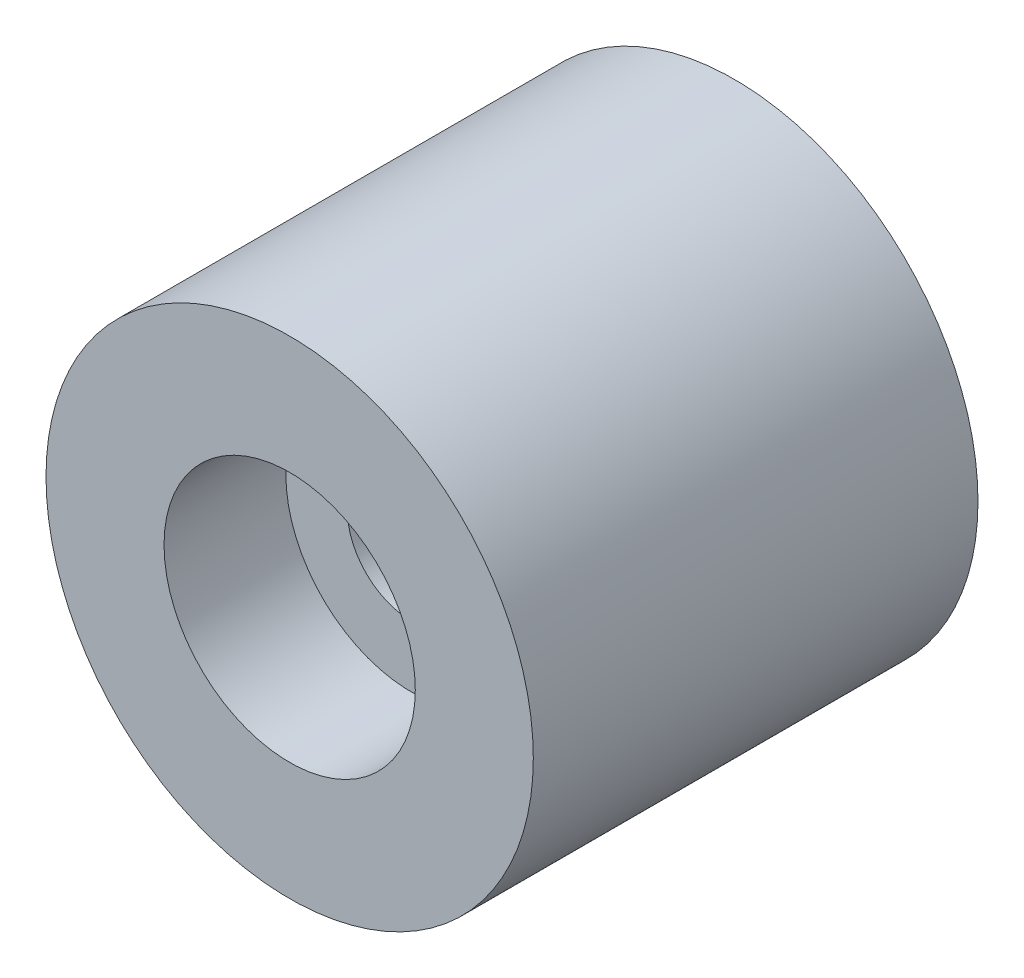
ISO-10303-21;
HEADER;
FILE_DESCRIPTION(('STEP AP214'),'2;1');
FILE_NAME('part.step','',(''),(''),'','','');
FILE_SCHEMA(('AUTOMOTIVE_DESIGN { 1 0 10303 214 1 1 1 1 }'));
ENDSEC;
DATA;
#1=APPLICATION_CONTEXT('core data for automotive mechanical design processes');
#2=APPLICATION_PROTOCOL_DEFINITION('international standard','automotive_design',2000,#1);
#3=PRODUCT_CONTEXT('',#1,'mechanical');
#4=PRODUCT('Part','Part','',(#3));
#5=PRODUCT_RELATED_PRODUCT_CATEGORY('part','',(#4));
#6=PRODUCT_DEFINITION_FORMATION('','',#4);
#7=PRODUCT_DEFINITION_CONTEXT('part definition',#1,'design');
#8=PRODUCT_DEFINITION('design','',#6,#7);
#9=PRODUCT_DEFINITION_SHAPE('','',#8);
#10=(LENGTH_UNIT() NAMED_UNIT(*) SI_UNIT(.MILLI.,.METRE.));
#11=(NAMED_UNIT(*) PLANE_ANGLE_UNIT() SI_UNIT($,.RADIAN.));
#12=(NAMED_UNIT(*) SI_UNIT($,.STERADIAN.) SOLID_ANGLE_UNIT());
#13=UNCERTAINTY_MEASURE_WITH_UNIT(LENGTH_MEASURE(1.E-05),#10,'distance_accuracy_value','');
#14=(GEOMETRIC_REPRESENTATION_CONTEXT(3) GLOBAL_UNCERTAINTY_ASSIGNED_CONTEXT((#13)) GLOBAL_UNIT_ASSIGNED_CONTEXT((#10,
#11,#12)) REPRESENTATION_CONTEXT('',''));
#15=CARTESIAN_POINT('',(0.,0.,0.));
#16=DIRECTION('',(0.,0.,1.));
#17=DIRECTION('',(1.,0.,0.));
#18=AXIS2_PLACEMENT_3D('',#15,#16,#17);
#19=CARTESIAN_POINT('',(0.,0.,0.));
#20=DIRECTION('',(0.,0.,1.));
#21=DIRECTION('',(1.,0.,0.));
#22=AXIS2_PLACEMENT_3D('',#19,#20,#21);
#23=CYLINDRICAL_SURFACE('',#22,2.1082);
#24=CARTESIAN_POINT('',(0.,0.,10.6));
#25=DIRECTION('',(0.,0.,1.));
#26=DIRECTION('',(1.,0.,0.));
#27=AXIS2_PLACEMENT_3D('',#24,#25,#26);
#28=CIRCLE('',#27,2.1082);
#29=CARTESIAN_POINT('',(2.1082,0.,10.6));
#30=VERTEX_POINT('',#29);
#31=EDGE_CURVE('E10',#30,#30,#28,.T.);
#32=ORIENTED_EDGE('',*,*,#31,.T.);
#33=EDGE_LOOP('',(#32));
#34=FACE_BOUND('',#33,.T.);
#35=CARTESIAN_POINT('',(0.,0.,0.));
#36=DIRECTION('',(0.,0.,1.));
#37=DIRECTION('',(1.,0.,0.));
#38=AXIS2_PLACEMENT_3D('',#35,#36,#37);
#39=CIRCLE('',#38,2.1082);
#40=CARTESIAN_POINT('',(2.1082,0.,0.));
#41=VERTEX_POINT('',#40);
#42=EDGE_CURVE('E53',#41,#41,#39,.T.);
#43=ORIENTED_EDGE('',*,*,#42,.F.);
#44=EDGE_LOOP('',(#43));
#45=FACE_BOUND('',#44,.T.);
#46=ADVANCED_FACE('F31',(#34,#45),#23,.F.);
#47=CARTESIAN_POINT('',(2.1082,0.,10.6));
#48=DIRECTION('',(0.,0.,1.));
#49=DIRECTION('',(1.,0.,0.));
#50=AXIS2_PLACEMENT_3D('',#47,#48,#49);
#51=PLANE('',#50);
#52=CARTESIAN_POINT('',(0.,0.,10.6));
#53=DIRECTION('',(0.,0.,1.));
#54=DIRECTION('',(1.,0.,0.));
#55=AXIS2_PLACEMENT_3D('',#52,#53,#54);
#56=CIRCLE('',#55,4.125);
#57=CARTESIAN_POINT('',(4.125,0.,10.6));
#58=VERTEX_POINT('',#57);
#59=EDGE_CURVE('E37',#58,#58,#56,.T.);
#60=ORIENTED_EDGE('',*,*,#59,.T.);
#61=EDGE_LOOP('',(#60));
#62=FACE_BOUND('',#61,.T.);
#63=ORIENTED_EDGE('',*,*,#31,.F.);
#64=EDGE_LOOP('',(#63));
#65=FACE_BOUND('',#64,.T.);
#66=ADVANCED_FACE('F61',(#62,#65),#51,.T.);
#67=CARTESIAN_POINT('',(0.,0.,0.));
#68=DIRECTION('',(0.,0.,1.));
#69=DIRECTION('',(1.,0.,0.));
#70=AXIS2_PLACEMENT_3D('',#67,#68,#69);
#71=CYLINDRICAL_SURFACE('',#70,4.125);
#72=CARTESIAN_POINT('',(0.,0.,14.6));
#73=DIRECTION('',(0.,0.,1.));
#74=DIRECTION('',(1.,0.,0.));
#75=AXIS2_PLACEMENT_3D('',#72,#73,#74);
#76=CIRCLE('',#75,4.125);
#77=CARTESIAN_POINT('',(4.125,0.,14.6));
#78=VERTEX_POINT('',#77);
#79=EDGE_CURVE('E41',#78,#78,#76,.T.);
#80=ORIENTED_EDGE('',*,*,#79,.T.);
#81=EDGE_LOOP('',(#80));
#82=FACE_BOUND('',#81,.T.);
#83=ORIENTED_EDGE('',*,*,#59,.F.);
#84=EDGE_LOOP('',(#83));
#85=FACE_BOUND('',#84,.T.);
#86=ADVANCED_FACE('F65',(#82,#85),#71,.F.);
#87=CARTESIAN_POINT('',(4.125,0.,14.6));
#88=DIRECTION('',(0.,0.,1.));
#89=DIRECTION('',(1.,0.,0.));
#90=AXIS2_PLACEMENT_3D('',#87,#88,#89);
#91=PLANE('',#90);
#92=CARTESIAN_POINT('',(0.,0.,14.6));
#93=DIRECTION('',(0.,0.,1.));
#94=DIRECTION('',(1.,0.,0.));
#95=AXIS2_PLACEMENT_3D('',#92,#93,#94);
#96=CIRCLE('',#95,8.);
#97=CARTESIAN_POINT('',(8.,0.,14.6));
#98=VERTEX_POINT('',#97);
#99=EDGE_CURVE('E45',#98,#98,#96,.T.);
#100=ORIENTED_EDGE('',*,*,#99,.T.);
#101=EDGE_LOOP('',(#100));
#102=FACE_BOUND('',#101,.T.);
#103=ORIENTED_EDGE('',*,*,#79,.F.);
#104=EDGE_LOOP('',(#103));
#105=FACE_BOUND('',#104,.T.);
#106=ADVANCED_FACE('F69',(#102,#105),#91,.T.);
#107=CARTESIAN_POINT('',(0.,0.,0.));
#108=DIRECTION('',(0.,0.,1.));
#109=DIRECTION('',(1.,0.,0.));
#110=AXIS2_PLACEMENT_3D('',#107,#108,#109);
#111=CYLINDRICAL_SURFACE('',#110,8.);
#112=CARTESIAN_POINT('',(0.,0.,0.));
#113=DIRECTION('',(0.,0.,1.));
#114=DIRECTION('',(1.,0.,0.));
#115=AXIS2_PLACEMENT_3D('',#112,#113,#114);
#116=CIRCLE('',#115,8.);
#117=CARTESIAN_POINT('',(8.,0.,0.));
#118=VERTEX_POINT('',#117);
#119=EDGE_CURVE('E50',#118,#118,#116,.T.);
#120=ORIENTED_EDGE('',*,*,#119,.T.);
#121=EDGE_LOOP('',(#120));
#122=FACE_BOUND('',#121,.T.);
#123=ORIENTED_EDGE('',*,*,#99,.F.);
#124=EDGE_LOOP('',(#123));
#125=FACE_BOUND('',#124,.T.);
#126=ADVANCED_FACE('F76',(#122,#125),#111,.T.);
#127=CARTESIAN_POINT('',(8.,0.,0.));
#128=DIRECTION('',(0.,0.,-1.));
#129=DIRECTION('',(-1.,0.,0.));
#130=AXIS2_PLACEMENT_3D('',#127,#128,#129);
#131=PLANE('',#130);
#132=ORIENTED_EDGE('',*,*,#42,.T.);
#133=EDGE_LOOP('',(#132));
#134=FACE_BOUND('',#133,.T.);
#135=ORIENTED_EDGE('',*,*,#119,.F.);
#136=EDGE_LOOP('',(#135));
#137=FACE_BOUND('',#136,.T.);
#138=ADVANCED_FACE('F57',(#134,#137),#131,.T.);
#139=CLOSED_SHELL('',(#46,#66,#86,#106,#126,#138));
#140=MANIFOLD_SOLID_BREP('B2',#139);
#141=ADVANCED_BREP_SHAPE_REPRESENTATION('',(#18,#140),#14);
#142=SHAPE_DEFINITION_REPRESENTATION(#9,#141);
ENDSEC;
END-ISO-10303-21;
